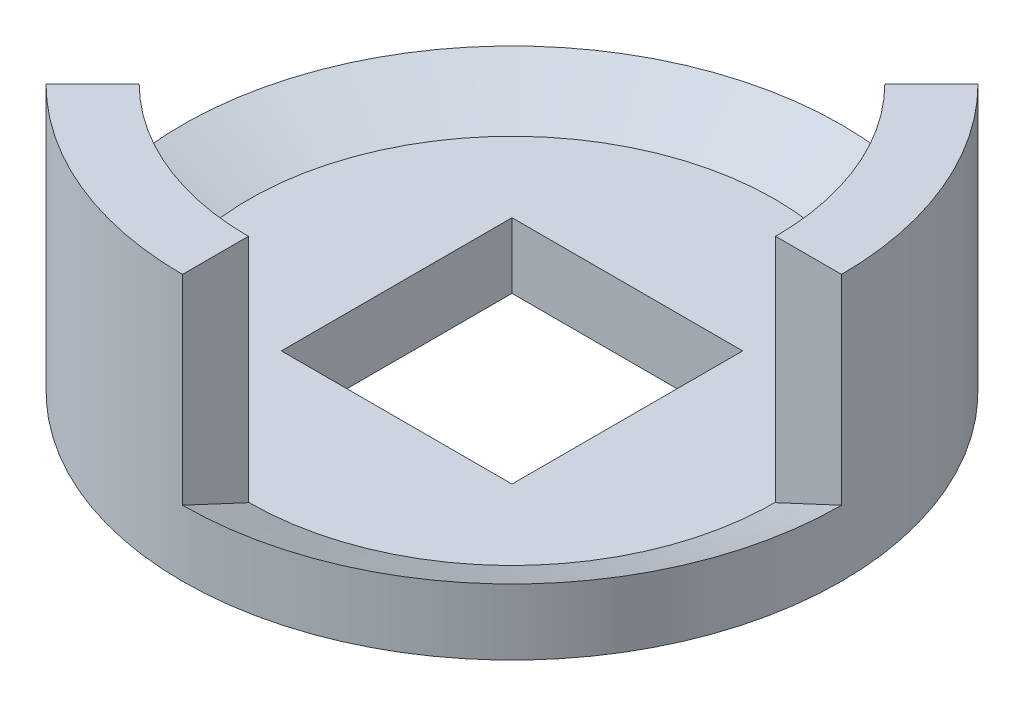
from build123d import *
from build123d.topology import SkipClean

# Parameters (mm, degrees)
ESQUISSE2_W        = 7
ESQUISSE2_H        = 7
CARR_CENTRAL_DEPTH = 15.281380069
BUT_ES_START       = -8
BUT_ES_DEPTH       = 8


with BuildPart() as part:
    # Esquisse1 → Base-R_volution (revolve)
    with BuildSketch(Plane.XY, mode=Mode.PRIVATE) as base_r_volution_sk:
        Polygon((0, 0), (8, 0), (10, 0.932615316), (10, 2.932615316), (7.977324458, 1.989426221), (0, 1.989426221), align=None)
    revolve(base_r_volution_sk.sketch.rotate(Axis((0, 0, 0), (0, 1, 0)), 90), axis=Axis((0, 0, 0), (0, 1, 0)))

    # Esquisse2 → Carr_ central (cut, through all)
    with BuildSketch(Plane(origin=(0, 1.989426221, 0), x_dir=(-1, 0, 0), z_dir=(0, 1, 0))):
        Rectangle(ESQUISSE2_W, ESQUISSE2_H)
    extrude(amount=-CARR_CENTRAL_DEPTH, mode=Mode.SUBTRACT)

    # Esquisse3 → But_es (add)
    with SkipClean():  # the faces are left unmerged after this step: merging them gives an invalid solid
        with BuildSketch(Plane.XZ.offset(-1).offset(BUT_ES_START)):
            with BuildLine():
                Line((7.071067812, -7.071067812), (5.656854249, -5.656854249))
                ThreePointArc((5.656854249, -5.656854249), (7.39103626, -3.061467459), (8, 0))
                Line((8, 0), (10, 0))
                ThreePointArc((10, 0), (9.238795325, -3.826834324), (7.071067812, -7.071067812))
            make_face()
            with BuildLine():
                Line((-7.071067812, 7.071067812), (-5.656854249, 5.656854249))
                ThreePointArc((-5.656854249, 5.656854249), (-3.061467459, 7.39103626), (0, 8))
                Line((0, 8), (0, 10))
                ThreePointArc((0, 10), (-3.826834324, 9.238795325), (-7.071067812, 7.071067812))
            make_face()
        extrude(amount=BUT_ES_DEPTH)


solid = part.part
